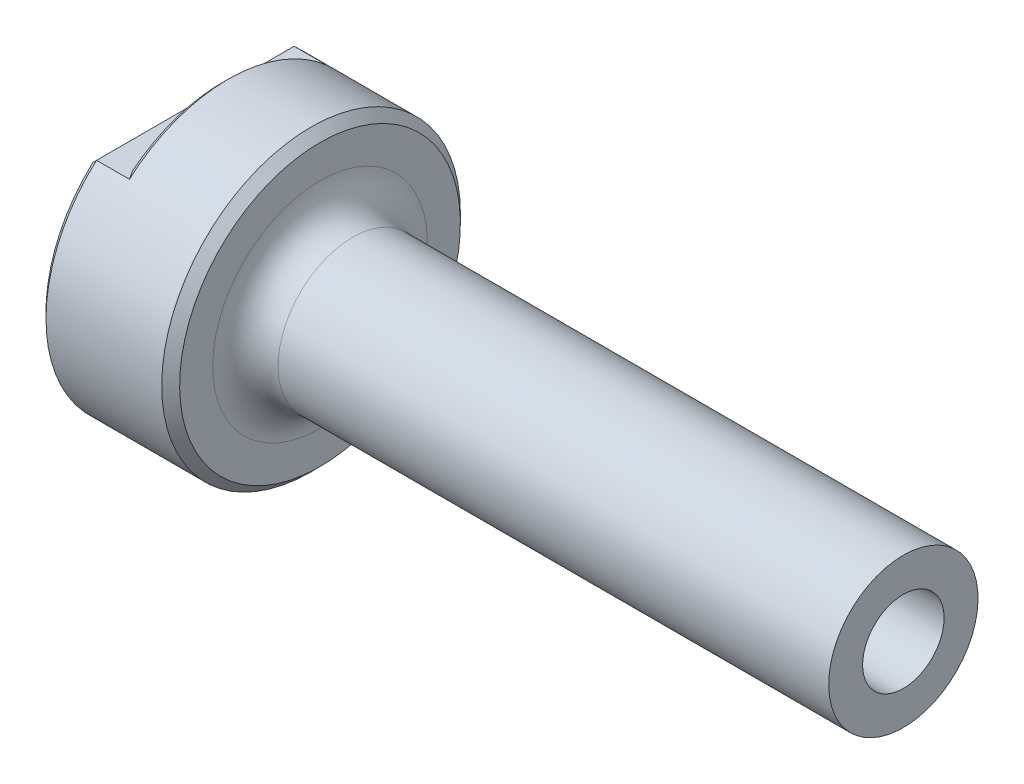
ISO-10303-21;
HEADER;
FILE_DESCRIPTION(('STEP AP214'),'2;1');
FILE_NAME('part.step','',(''),(''),'','','');
FILE_SCHEMA(('AUTOMOTIVE_DESIGN { 1 0 10303 214 1 1 1 1 }'));
ENDSEC;
DATA;
#1=APPLICATION_CONTEXT('core data for automotive mechanical design processes');
#2=APPLICATION_PROTOCOL_DEFINITION('international standard','automotive_design',2000,#1);
#3=PRODUCT_CONTEXT('',#1,'mechanical');
#4=PRODUCT('Part','Part','',(#3));
#5=PRODUCT_RELATED_PRODUCT_CATEGORY('part','',(#4));
#6=PRODUCT_DEFINITION_FORMATION('','',#4);
#7=PRODUCT_DEFINITION_CONTEXT('part definition',#1,'design');
#8=PRODUCT_DEFINITION('design','',#6,#7);
#9=PRODUCT_DEFINITION_SHAPE('','',#8);
#10=(LENGTH_UNIT() NAMED_UNIT(*) SI_UNIT(.MILLI.,.METRE.));
#11=(NAMED_UNIT(*) PLANE_ANGLE_UNIT() SI_UNIT($,.RADIAN.));
#12=(NAMED_UNIT(*) SI_UNIT($,.STERADIAN.) SOLID_ANGLE_UNIT());
#13=UNCERTAINTY_MEASURE_WITH_UNIT(LENGTH_MEASURE(1.E-05),#10,'distance_accuracy_value','');
#14=(GEOMETRIC_REPRESENTATION_CONTEXT(3) GLOBAL_UNCERTAINTY_ASSIGNED_CONTEXT((#13)) GLOBAL_UNIT_ASSIGNED_CONTEXT((#10,
#11,#12)) REPRESENTATION_CONTEXT('',''));
#15=CARTESIAN_POINT('',(0.,0.,0.));
#16=DIRECTION('',(0.,0.,1.));
#17=DIRECTION('',(1.,0.,0.));
#18=AXIS2_PLACEMENT_3D('',#15,#16,#17);
#19=CARTESIAN_POINT('',(60.721875,0.,0.));
#20=DIRECTION('',(1.,0.,0.));
#21=DIRECTION('',(0.,0.,-1.));
#22=AXIS2_PLACEMENT_3D('',#19,#20,#21);
#23=PLANE('',#22);
#24=CARTESIAN_POINT('',(60.721875,0.,0.));
#25=DIRECTION('',(1.,0.,0.));
#26=DIRECTION('',(0.,1.,0.));
#27=AXIS2_PLACEMENT_3D('',#24,#25,#26);
#28=CIRCLE('',#27,12.7);
#29=CARTESIAN_POINT('',(60.721875,12.7,0.));
#30=VERTEX_POINT('',#29);
#31=EDGE_CURVE('E102',#30,#30,#28,.T.);
#32=ORIENTED_EDGE('',*,*,#31,.T.);
#33=EDGE_LOOP('',(#32));
#34=FACE_BOUND('',#33,.T.);
#35=CARTESIAN_POINT('',(60.721875,0.,0.));
#36=DIRECTION('',(1.,0.,0.));
#37=DIRECTION('',(0.,1.,0.));
#38=AXIS2_PLACEMENT_3D('',#35,#36,#37);
#39=CIRCLE('',#38,6.93155425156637);
#40=CARTESIAN_POINT('',(60.721875,6.93155425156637,0.));
#41=VERTEX_POINT('',#40);
#42=EDGE_CURVE('E158',#41,#41,#39,.T.);
#43=ORIENTED_EDGE('',*,*,#42,.F.);
#44=EDGE_LOOP('',(#43));
#45=FACE_BOUND('',#44,.T.);
#46=ADVANCED_FACE('F33',(#34,#45),#23,.T.);
#47=CARTESIAN_POINT('',(-60.721875,0.,0.));
#48=DIRECTION('',(1.,0.,0.));
#49=DIRECTION('',(0.,0.,-1.));
#50=AXIS2_PLACEMENT_3D('',#47,#48,#49);
#51=PLANE('',#50);
#52=CARTESIAN_POINT('',(-60.721875,0.,0.));
#53=DIRECTION('',(1.,0.,0.));
#54=DIRECTION('',(0.,0.,-1.));
#55=AXIS2_PLACEMENT_3D('',#52,#53,#54);
#56=CIRCLE('',#55,24.3839999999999);
#57=CARTESIAN_POINT('',(-60.721875,18.0339999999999,-16.4120169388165));
#58=VERTEX_POINT('',#57);
#59=CARTESIAN_POINT('',(-60.721875,18.0339999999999,16.4120169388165));
#60=VERTEX_POINT('',#59);
#61=EDGE_CURVE('E53',#58,#60,#56,.F.);
#62=ORIENTED_EDGE('',*,*,#61,.T.);
#63=DIRECTION('',(0.,0.,-1.));
#64=VECTOR('',#63,1.);
#65=CARTESIAN_POINT('',(-60.721875,18.0339999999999,0.));
#66=LINE('',#65,#64);
#67=EDGE_CURVE('E127',#60,#58,#66,.T.);
#68=ORIENTED_EDGE('',*,*,#67,.T.);
#69=EDGE_LOOP('',(#62,#68));
#70=FACE_BOUND('',#69,.T.);
#71=CARTESIAN_POINT('',(-60.721875,0.,0.));
#72=DIRECTION('',(1.,0.,0.));
#73=DIRECTION('',(0.,1.,0.));
#74=AXIS2_PLACEMENT_3D('',#71,#72,#73);
#75=CIRCLE('',#74,9.80045101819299);
#76=CARTESIAN_POINT('',(-60.721875,9.80045101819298,0.));
#77=VERTEX_POINT('',#76);
#78=EDGE_CURVE('E107',#77,#77,#75,.T.);
#79=ORIENTED_EDGE('',*,*,#78,.T.);
#80=EDGE_LOOP('',(#79));
#81=FACE_BOUND('',#80,.T.);
#82=ADVANCED_FACE('F167',(#70,#81),#51,.F.);
#83=CARTESIAN_POINT('',(60.721875,0.,0.));
#84=DIRECTION('',(-1.,0.,0.));
#85=DIRECTION('',(0.,0.,1.));
#86=AXIS2_PLACEMENT_3D('',#83,#84,#85);
#87=CYLINDRICAL_SURFACE('',#86,25.4);
#88=CARTESIAN_POINT('',(-40.0208749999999,0.,0.));
#89=DIRECTION('',(1.,0.,0.));
#90=DIRECTION('',(0.,0.,-1.));
#91=AXIS2_PLACEMENT_3D('',#88,#89,#90);
#92=CIRCLE('',#91,25.4);
#93=CARTESIAN_POINT('',(-40.0208749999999,0.,-25.4));
#94=VERTEX_POINT('',#93);
#95=EDGE_CURVE('E98',#94,#94,#92,.F.);
#96=ORIENTED_EDGE('',*,*,#95,.T.);
#97=EDGE_LOOP('',(#96));
#98=FACE_BOUND('',#97,.T.);
#99=DIRECTION('',(-1.,0.,0.));
#100=VECTOR('',#99,1.);
#101=CARTESIAN_POINT('',(60.721875,19.05,-16.8005208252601));
#102=LINE('',#101,#100);
#103=CARTESIAN_POINT('',(-59.7058749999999,19.05,-16.8005208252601));
#104=VERTEX_POINT('',#103);
#105=CARTESIAN_POINT('',(-54.117875,19.05,-16.8005208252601));
#106=VERTEX_POINT('',#105);
#107=EDGE_CURVE('E101',#104,#106,#102,.F.);
#108=ORIENTED_EDGE('',*,*,#107,.T.);
#109=CARTESIAN_POINT('',(-54.117875,0.,0.));
#110=DIRECTION('',(-1.,0.,0.));
#111=DIRECTION('',(0.,0.,1.));
#112=AXIS2_PLACEMENT_3D('',#109,#110,#111);
#113=CIRCLE('',#112,25.4);
#114=CARTESIAN_POINT('',(-54.117875,19.05,16.8005208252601));
#115=VERTEX_POINT('',#114);
#116=EDGE_CURVE('E87',#106,#115,#113,.F.);
#117=ORIENTED_EDGE('',*,*,#116,.T.);
#118=DIRECTION('',(-1.,0.,0.));
#119=VECTOR('',#118,1.);
#120=CARTESIAN_POINT('',(60.721875,19.05,16.8005208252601));
#121=LINE('',#120,#119);
#122=CARTESIAN_POINT('',(-59.7058749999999,19.05,16.8005208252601));
#123=VERTEX_POINT('',#122);
#124=EDGE_CURVE('E104',#115,#123,#121,.T.);
#125=ORIENTED_EDGE('',*,*,#124,.T.);
#126=CARTESIAN_POINT('',(-59.7058749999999,0.,0.));
#127=DIRECTION('',(1.,0.,0.));
#128=DIRECTION('',(0.,0.,-1.));
#129=AXIS2_PLACEMENT_3D('',#126,#127,#128);
#130=CIRCLE('',#129,25.4);
#131=EDGE_CURVE('E97',#123,#104,#130,.T.);
#132=ORIENTED_EDGE('',*,*,#131,.T.);
#133=EDGE_LOOP('',(#108,#117,#125,#132));
#134=FACE_BOUND('',#133,.T.);
#135=ADVANCED_FACE('F189',(#98,#134),#87,.T.);
#136=CARTESIAN_POINT('',(-55.133875,0.,0.));
#137=DIRECTION('',(-1.,0.,0.));
#138=DIRECTION('',(0.,0.,1.));
#139=AXIS2_PLACEMENT_3D('',#136,#137,#138);
#140=PLANE('',#139);
#141=DIRECTION('',(0.,0.,1.));
#142=VECTOR('',#141,1.);
#143=CARTESIAN_POINT('',(-55.133875,19.05,-25.4));
#144=LINE('',#143,#142);
#145=CARTESIAN_POINT('',(-55.133875,19.05,-15.220938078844));
#146=VERTEX_POINT('',#145);
#147=CARTESIAN_POINT('',(-55.133875,19.05,15.220938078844));
#148=VERTEX_POINT('',#147);
#149=EDGE_CURVE('E96',#146,#148,#144,.T.);
#150=ORIENTED_EDGE('',*,*,#149,.T.);
#151=CARTESIAN_POINT('',(-55.133875,0.,0.));
#152=DIRECTION('',(-1.,0.,0.));
#153=DIRECTION('',(0.,0.,1.));
#154=AXIS2_PLACEMENT_3D('',#151,#152,#153);
#155=CIRCLE('',#154,24.384);
#156=EDGE_CURVE('E85',#148,#146,#155,.T.);
#157=ORIENTED_EDGE('',*,*,#156,.T.);
#158=EDGE_LOOP('',(#150,#157));
#159=FACE_BOUND('',#158,.T.);
#160=ADVANCED_FACE('F95',(#159),#140,.T.);
#161=CARTESIAN_POINT('',(-55.133875,19.05,-25.4));
#162=DIRECTION('',(0.,-1.,0.));
#163=DIRECTION('',(0.,0.,-1.));
#164=AXIS2_PLACEMENT_3D('',#161,#162,#163);
#165=PLANE('',#164);
#166=ORIENTED_EDGE('',*,*,#107,.F.);
#167=DIRECTION('',(0.,0.,1.));
#168=VECTOR('',#167,1.);
#169=CARTESIAN_POINT('',(-59.7058749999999,19.05,-25.4));
#170=LINE('',#169,#168);
#171=EDGE_CURVE('E91',#104,#123,#170,.T.);
#172=ORIENTED_EDGE('',*,*,#171,.T.);
#173=ORIENTED_EDGE('',*,*,#124,.F.);
#174=CARTESIAN_POINT('',(-54.117875,19.05,16.8005208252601));
#175=CARTESIAN_POINT('',(-54.2042219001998,19.05,16.6699759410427));
#176=CARTESIAN_POINT('',(-54.290175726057,19.05,16.5391707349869));
#177=CARTESIAN_POINT('',(-54.4612541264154,19.05,16.2770272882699));
#178=CARTESIAN_POINT('',(-54.5463787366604,19.05,16.1456890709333));
#179=CARTESIAN_POINT('',(-54.7157633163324,19.05,15.8824555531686));
#180=CARTESIAN_POINT('',(-54.8000232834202,19.05,15.7505602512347));
#181=CARTESIAN_POINT('',(-54.9676390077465,19.05,15.4861884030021));
#182=CARTESIAN_POINT('',(-55.0509947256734,19.05,15.353711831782));
#183=CARTESIAN_POINT('',(-55.133875,19.05,15.220938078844));
#184=B_SPLINE_CURVE_WITH_KNOTS('',3,(#174,#175,#176,#177,#178,#179,#180,#181,#182,#183),
.UNSPECIFIED.,.F.,.F.,(4,2,2,2,4),(0.,0.469552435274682,0.939084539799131,1.40861791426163,
1.87817162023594),.UNSPECIFIED.);
#185=EDGE_CURVE('E11',#115,#148,#184,.T.);
#186=ORIENTED_EDGE('',*,*,#185,.T.);
#187=ORIENTED_EDGE('',*,*,#149,.F.);
#188=CARTESIAN_POINT('',(-55.133875,19.05,-15.220938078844));
#189=CARTESIAN_POINT('',(-55.0509947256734,19.05,-15.353711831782));
#190=CARTESIAN_POINT('',(-54.9676390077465,19.05,-15.4861884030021));
#191=CARTESIAN_POINT('',(-54.8000232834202,19.05,-15.7505602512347));
#192=CARTESIAN_POINT('',(-54.7157633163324,19.05,-15.8824555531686));
#193=CARTESIAN_POINT('',(-54.5463787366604,19.05,-16.1456890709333));
#194=CARTESIAN_POINT('',(-54.4612541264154,19.05,-16.2770272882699));
#195=CARTESIAN_POINT('',(-54.290175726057,19.05,-16.5391707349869));
#196=CARTESIAN_POINT('',(-54.2042219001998,19.05,-16.6699759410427));
#197=CARTESIAN_POINT('',(-54.117875,19.05,-16.8005208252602));
#198=B_SPLINE_CURVE_WITH_KNOTS('',3,(#188,#189,#190,#191,#192,#193,#194,#195,#196,#197),
.UNSPECIFIED.,.F.,.F.,(4,2,2,2,4),(0.,0.46955370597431,0.939087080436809,1.40861918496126,
1.87817162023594),.UNSPECIFIED.);
#199=EDGE_CURVE('E46',#146,#106,#198,.T.);
#200=ORIENTED_EDGE('',*,*,#199,.T.);
#201=EDGE_LOOP('',(#166,#172,#173,#186,#187,#200));
#202=FACE_BOUND('',#201,.T.);
#203=ADVANCED_FACE('F100',(#202),#165,.F.);
#204=CARTESIAN_POINT('',(-38.496875,-25.4,0.));
#205=DIRECTION('',(1.,0.,0.));
#206=DIRECTION('',(0.,1.,0.));
#207=AXIS2_PLACEMENT_3D('',#204,#205,#206);
#208=PLANE('',#207);
#209=CARTESIAN_POINT('',(-38.496875,0.,0.));
#210=DIRECTION('',(1.,0.,0.));
#211=DIRECTION('',(0.,1.,0.));
#212=AXIS2_PLACEMENT_3D('',#209,#210,#211);
#213=CIRCLE('',#212,23.8760000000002);
#214=CARTESIAN_POINT('',(-38.496875,23.8760000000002,0.));
#215=VERTEX_POINT('',#214);
#216=EDGE_CURVE('E119',#215,#215,#213,.T.);
#217=ORIENTED_EDGE('',*,*,#216,.T.);
#218=EDGE_LOOP('',(#217));
#219=FACE_BOUND('',#218,.T.);
#220=CARTESIAN_POINT('',(-38.496875,0.,0.));
#221=DIRECTION('',(1.,0.,0.));
#222=DIRECTION('',(0.,1.,0.));
#223=AXIS2_PLACEMENT_3D('',#220,#221,#222);
#224=CIRCLE('',#223,18.25625);
#225=CARTESIAN_POINT('',(-38.496875,18.25625,0.));
#226=VERTEX_POINT('',#225);
#227=EDGE_CURVE('E116',#226,#226,#224,.F.);
#228=ORIENTED_EDGE('',*,*,#227,.T.);
#229=EDGE_LOOP('',(#228));
#230=FACE_BOUND('',#229,.T.);
#231=ADVANCED_FACE('F181',(#219,#230),#208,.T.);
#232=CARTESIAN_POINT('',(60.721875,0.,0.));
#233=DIRECTION('',(1.,0.,0.));
#234=DIRECTION('',(0.,1.,0.));
#235=AXIS2_PLACEMENT_3D('',#232,#233,#234);
#236=CYLINDRICAL_SURFACE('',#235,12.7);
#237=CARTESIAN_POINT('',(-32.940625,0.,0.));
#238=DIRECTION('',(1.,0.,0.));
#239=DIRECTION('',(0.,1.,0.));
#240=AXIS2_PLACEMENT_3D('',#237,#238,#239);
#241=CIRCLE('',#240,12.7);
#242=CARTESIAN_POINT('',(-32.940625,12.7,0.));
#243=VERTEX_POINT('',#242);
#244=EDGE_CURVE('E113',#243,#243,#241,.T.);
#245=ORIENTED_EDGE('',*,*,#244,.T.);
#246=EDGE_LOOP('',(#245));
#247=FACE_BOUND('',#246,.T.);
#248=ORIENTED_EDGE('',*,*,#31,.F.);
#249=EDGE_LOOP('',(#248));
#250=FACE_BOUND('',#249,.T.);
#251=ADVANCED_FACE('F172',(#247,#250),#236,.T.);
#252=CARTESIAN_POINT('',(-68.799075,0.,0.));
#253=DIRECTION('',(1.,0.,0.));
#254=DIRECTION('',(0.,1.,0.));
#255=AXIS2_PLACEMENT_3D('',#252,#253,#254);
#256=SPHERICAL_SURFACE('',#255,12.7);
#257=CARTESIAN_POINT('',(-56.8729977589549,0.,0.));
#258=DIRECTION('',(1.,0.,0.));
#259=DIRECTION('',(0.,1.,0.));
#260=AXIS2_PLACEMENT_3D('',#257,#258,#259);
#261=CIRCLE('',#260,4.365625);
#262=CARTESIAN_POINT('',(-56.8729977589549,4.365625,0.));
#263=VERTEX_POINT('',#262);
#264=EDGE_CURVE('E155',#263,#263,#261,.T.);
#265=CARTESIAN_POINT('',(-56.8729977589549,4.365625,0.));
#266=CARTESIAN_POINT('',(-56.8971262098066,4.43153961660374,0.));
#267=CARTESIAN_POINT('',(-56.9218012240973,4.4972541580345,0.));
#268=CARTESIAN_POINT('',(-56.9722373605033,4.62826511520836,0.));
#269=CARTESIAN_POINT('',(-56.9979984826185,4.69356153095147,0.));
#270=CARTESIAN_POINT('',(-57.05059981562,4.82371826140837,0.));
#271=CARTESIAN_POINT('',(-57.0774400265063,4.88857857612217,0.));
#272=CARTESIAN_POINT('',(-57.1321921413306,5.01784527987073,0.));
#273=CARTESIAN_POINT('',(-57.1601040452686,5.08225166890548,0.));
#274=CARTESIAN_POINT('',(-57.216991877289,5.21059281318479,0.));
#275=CARTESIAN_POINT('',(-57.2459678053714,5.27452756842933,0.));
#276=CARTESIAN_POINT('',(-57.3049757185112,5.40190786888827,0.));
#277=CARTESIAN_POINT('',(-57.3350077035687,5.46535341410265,0.));
#278=CARTESIAN_POINT('',(-57.3961194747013,5.59173785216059,0.));
#279=CARTESIAN_POINT('',(-57.4271992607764,5.65467674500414,0.));
#280=CARTESIAN_POINT('',(-57.490398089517,5.7800305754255,0.));
#281=CARTESIAN_POINT('',(-57.5225171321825,5.8424455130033,0.));
#282=CARTESIAN_POINT('',(-57.5877856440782,5.96673427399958,0.));
#283=CARTESIAN_POINT('',(-57.6209351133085,6.02860809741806,0.));
#284=CARTESIAN_POINT('',(-57.6882553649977,6.15179761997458,0.));
#285=CARTESIAN_POINT('',(-57.7224261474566,6.21311331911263,0.));
#286=CARTESIAN_POINT('',(-57.7917796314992,6.33516973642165,0.));
#287=CARTESIAN_POINT('',(-57.8269623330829,6.39591045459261,0.));
#288=CARTESIAN_POINT('',(-57.898329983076,6.51680021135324,0.));
#289=CARTESIAN_POINT('',(-57.9345149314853,6.57694924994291,0.));
#290=CARTESIAN_POINT('',(-58.0078771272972,6.69663911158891,0.));
#291=CARTESIAN_POINT('',(-58.0450543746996,6.75617993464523,0.));
#292=CARTESIAN_POINT('',(-58.1203909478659,6.87463699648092,0.));
#293=CARTESIAN_POINT('',(-58.1585502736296,6.93355323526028,0.));
#294=CARTESIAN_POINT('',(-58.2358405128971,7.05074493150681,0.));
#295=CARTESIAN_POINT('',(-58.2749714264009,7.10902038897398,0.));
#296=CARTESIAN_POINT('',(-58.3541940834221,7.22491450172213,0.));
#297=CARTESIAN_POINT('',(-58.3942858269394,7.28253315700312,0.));
#298=CARTESIAN_POINT('',(-58.4754191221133,7.39709782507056,0.));
#299=CARTESIAN_POINT('',(-58.5164606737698,7.45404383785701,0.));
#300=CARTESIAN_POINT('',(-58.5994823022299,7.56724756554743,0.));
#301=CARTESIAN_POINT('',(-58.6414623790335,7.62350528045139,0.));
#302=CARTESIAN_POINT('',(-58.7263495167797,7.73531694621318,0.));
#303=CARTESIAN_POINT('',(-58.7692565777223,7.79087089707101,0.));
#304=CARTESIAN_POINT('',(-58.8559858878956,7.90125976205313,0.));
#305=CARTESIAN_POINT('',(-58.8998081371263,7.95609467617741,0.));
#306=CARTESIAN_POINT('',(-58.9883557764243,8.06503039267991,0.));
#307=CARTESIAN_POINT('',(-59.0330811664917,8.11913119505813,0.));
#308=CARTESIAN_POINT('',(-59.1234227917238,8.2265838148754,0.));
#309=CARTESIAN_POINT('',(-59.1690390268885,8.27993563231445,0.));
#310=CARTESIAN_POINT('',(-59.2611498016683,8.385875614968,0.));
#311=CARTESIAN_POINT('',(-59.3076443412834,8.43846378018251,0.));
#312=CARTESIAN_POINT('',(-59.4014989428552,8.54286200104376,0.));
#313=CARTESIAN_POINT('',(-59.448859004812,8.59467205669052,0.));
#314=CARTESIAN_POINT('',(-59.5444316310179,8.69749981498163,0.));
#315=CARTESIAN_POINT('',(-59.5926441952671,8.74851751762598,0.));
#316=CARTESIAN_POINT('',(-59.689908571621,8.84974654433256,0.));
#317=CARTESIAN_POINT('',(-59.7389603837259,8.89995786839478,0.));
#318=CARTESIAN_POINT('',(-59.8378897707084,8.99956033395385,0.));
#319=CARTESIAN_POINT('',(-59.8877673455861,9.04895147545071,0.));
#320=CARTESIAN_POINT('',(-59.9883345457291,9.14689999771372,0.));
#321=CARTESIAN_POINT('',(-60.0390241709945,9.19545737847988,0.));
#322=CARTESIAN_POINT('',(-60.1412015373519,9.29172502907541,0.));
#323=CARTESIAN_POINT('',(-60.1926892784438,9.33943529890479,0.));
#324=CARTESIAN_POINT('',(-60.2964487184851,9.43399561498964,0.));
#325=CARTESIAN_POINT('',(-60.3487204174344,9.48084566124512,0.));
#326=CARTESIAN_POINT('',(-60.4540334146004,9.57367263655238,0.));
#327=CARTESIAN_POINT('',(-60.507074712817,9.61964956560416,0.));
#328=CARTESIAN_POINT('',(-60.6139122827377,9.71071771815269,0.));
#329=CARTESIAN_POINT('',(-60.6677085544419,9.75580894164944,0.));
#330=CARTESIAN_POINT('',(-60.721875,9.80045101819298,0.));
#331=B_SPLINE_CURVE_WITH_KNOTS('',3,(#265,#266,#267,#268,#269,#270,#271,#272,#273,#274,#275,
#276,#277,#278,#279,#280,#281,#282,#283,#284,#285,#286,#287,#288,#289,#290,#291,#292,#293,#294,
#295,#296,#297,#298,#299,#300,#301,#302,#303,#304,#305,#306,#307,#308,#309,#310,#311,#312,#313,
#314,#315,#316,#317,#318,#319,#320,#321,#322,#323,#324,#325,#326,#327,#328,#329,#330),
.UNSPECIFIED.,.F.,.F.,(4,2,2,2,2,2,2,2,2,2,2,2,2,2,2,2,2,2,2,2,2,2,2,2,2,2,2,2,2,2,2,2,4),(0.,
0.210573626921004,0.421147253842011,0.631720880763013,0.842294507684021,1.05286813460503,
1.26344176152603,1.47401538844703,1.68458901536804,1.89516264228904,2.10573626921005,
2.31630989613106,2.52688352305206,2.73745714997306,2.94803077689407,3.15860440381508,
3.36917803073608,3.57975165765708,3.79032528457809,4.00089891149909,4.2114725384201,
4.4220461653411,4.63261979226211,4.84319341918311,5.05376704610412,5.26434067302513,
5.47491429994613,5.68548792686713,5.89606155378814,6.10663518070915,6.31720880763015,
6.52778243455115,6.73835606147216),.UNSPECIFIED.);
#332=EDGE_CURVE('BSEAM169',#263,#77,#331,.T.);
#333=ORIENTED_EDGE('',*,*,#264,.T.);
#334=ORIENTED_EDGE('',*,*,#78,.F.);
#335=ORIENTED_EDGE('',*,*,#332,.T.);
#336=ORIENTED_EDGE('',*,*,#332,.F.);
#337=EDGE_LOOP('',(#333,#335,#334,#336));
#338=FACE_BOUND('',#337,.T.);
#339=ADVANCED_FACE('F169',(#338),#256,.F.);
#340=CARTESIAN_POINT('',(-56.8729977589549,0.,0.));
#341=DIRECTION('',(1.,0.,0.));
#342=DIRECTION('',(0.,1.,0.));
#343=AXIS2_PLACEMENT_3D('',#340,#341,#342);
#344=CONICAL_SURFACE('',#343,4.365625,0.0218166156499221);
#345=ORIENTED_EDGE('',*,*,#42,.T.);
#346=EDGE_LOOP('',(#345));
#347=FACE_BOUND('',#346,.T.);
#348=ORIENTED_EDGE('',*,*,#264,.F.);
#349=EDGE_LOOP('',(#348));
#350=FACE_BOUND('',#349,.T.);
#351=ADVANCED_FACE('F171',(#347,#350),#344,.F.);
#352=CARTESIAN_POINT('',(-32.940625,0.,0.));
#353=DIRECTION('',(1.,0.,0.));
#354=DIRECTION('',(0.,1.,0.));
#355=AXIS2_PLACEMENT_3D('',#352,#353,#354);
#356=TOROIDAL_SURFACE('',#355,18.25625,5.55625);
#357=ORIENTED_EDGE('',*,*,#227,.F.);
#358=EDGE_LOOP('',(#357));
#359=FACE_BOUND('',#358,.T.);
#360=ORIENTED_EDGE('',*,*,#244,.F.);
#361=EDGE_LOOP('',(#360));
#362=FACE_BOUND('',#361,.T.);
#363=ADVANCED_FACE('F178',(#359,#362),#356,.F.);
#364=CARTESIAN_POINT('',(-38.496875,0.,0.));
#365=DIRECTION('',(-1.,0.,0.));
#366=DIRECTION('',(0.,0.,1.));
#367=AXIS2_PLACEMENT_3D('',#364,#365,#366);
#368=CONICAL_SURFACE('',#367,23.8760000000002,0.785398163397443);
#369=ORIENTED_EDGE('',*,*,#95,.F.);
#370=EDGE_LOOP('',(#369));
#371=FACE_BOUND('',#370,.T.);
#372=ORIENTED_EDGE('',*,*,#216,.F.);
#373=EDGE_LOOP('',(#372));
#374=FACE_BOUND('',#373,.T.);
#375=ADVANCED_FACE('F145',(#371,#374),#368,.T.);
#376=CARTESIAN_POINT('',(-55.133875,0.,0.));
#377=DIRECTION('',(1.,0.,0.));
#378=DIRECTION('',(0.,0.,-1.));
#379=AXIS2_PLACEMENT_3D('',#376,#377,#378);
#380=CONICAL_SURFACE('',#379,24.384,0.785398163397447);
#381=ORIENTED_EDGE('',*,*,#185,.F.);
#382=ORIENTED_EDGE('',*,*,#116,.F.);
#383=ORIENTED_EDGE('',*,*,#199,.F.);
#384=ORIENTED_EDGE('',*,*,#156,.F.);
#385=EDGE_LOOP('',(#381,#382,#383,#384));
#386=FACE_BOUND('',#385,.T.);
#387=ADVANCED_FACE('F84',(#386),#380,.T.);
#388=CARTESIAN_POINT('',(-59.7058749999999,0.,0.));
#389=DIRECTION('',(1.,0.,0.));
#390=DIRECTION('',(0.,0.,-1.));
#391=AXIS2_PLACEMENT_3D('',#388,#389,#390);
#392=CONICAL_SURFACE('',#391,25.4,0.785398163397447);
#393=CARTESIAN_POINT('',(-60.721875,18.0339999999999,-16.4120169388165));
#394=CARTESIAN_POINT('',(-60.552676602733,18.203198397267,-16.4774733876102));
#395=CARTESIAN_POINT('',(-60.3834107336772,18.3724642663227,-16.5425769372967));
#396=CARTESIAN_POINT('',(-60.0447440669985,18.7111309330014,-16.6720782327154));
#397=CARTESIAN_POINT('',(-59.8753432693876,18.8805317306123,-16.7364759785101));
#398=CARTESIAN_POINT('',(-59.7058749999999,19.05,-16.8005208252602));
#399=B_SPLINE_CURVE_WITH_KNOTS('',3,(#393,#394,#395,#396,#397,#398),.UNSPECIFIED.,.F.,.F.,(4,2,
4),(0.,0.744219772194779,1.48843947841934),.UNSPECIFIED.);
#400=EDGE_CURVE('E61',#104,#58,#399,.F.);
#401=ORIENTED_EDGE('',*,*,#400,.F.);
#402=ORIENTED_EDGE('',*,*,#131,.F.);
#403=CARTESIAN_POINT('',(-59.7058749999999,19.05,16.8005208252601));
#404=CARTESIAN_POINT('',(-59.8753432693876,18.8805317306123,16.7364759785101));
#405=CARTESIAN_POINT('',(-60.0447440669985,18.7111309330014,16.6720782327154));
#406=CARTESIAN_POINT('',(-60.3834107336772,18.3724642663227,16.5425769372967));
#407=CARTESIAN_POINT('',(-60.552676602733,18.203198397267,16.4774733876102));
#408=CARTESIAN_POINT('',(-60.721875,18.0339999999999,16.4120169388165));
#409=B_SPLINE_CURVE_WITH_KNOTS('',3,(#403,#404,#405,#406,#407,#408),.UNSPECIFIED.,.F.,.F.,(4,2,
4),(0.,0.744219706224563,1.48843947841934),.UNSPECIFIED.);
#410=EDGE_CURVE('E38',#60,#123,#409,.F.);
#411=ORIENTED_EDGE('',*,*,#410,.F.);
#412=ORIENTED_EDGE('',*,*,#61,.F.);
#413=EDGE_LOOP('',(#401,#402,#411,#412));
#414=FACE_BOUND('',#413,.T.);
#415=ADVANCED_FACE('F144',(#414),#392,.T.);
#416=CARTESIAN_POINT('',(-60.721875,18.0339999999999,0.));
#417=DIRECTION('',(0.707106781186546,-0.707106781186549,0.));
#418=DIRECTION('',(0.,0.,-1.));
#419=AXIS2_PLACEMENT_3D('',#416,#417,#418);
#420=PLANE('',#419);
#421=ORIENTED_EDGE('',*,*,#410,.T.);
#422=ORIENTED_EDGE('',*,*,#171,.F.);
#423=ORIENTED_EDGE('',*,*,#400,.T.);
#424=ORIENTED_EDGE('',*,*,#67,.F.);
#425=EDGE_LOOP('',(#421,#422,#423,#424));
#426=FACE_BOUND('',#425,.T.);
#427=ADVANCED_FACE('F35',(#426),#420,.F.);
#428=CLOSED_SHELL('',(#46,#82,#135,#160,#203,#231,#251,#339,#351,#363,#375,#387,#415,#427));
#429=MANIFOLD_SOLID_BREP('B2',#428);
#430=ADVANCED_BREP_SHAPE_REPRESENTATION('',(#18,#429),#14);
#431=SHAPE_DEFINITION_REPRESENTATION(#9,#430);
ENDSEC;
END-ISO-10303-21;
